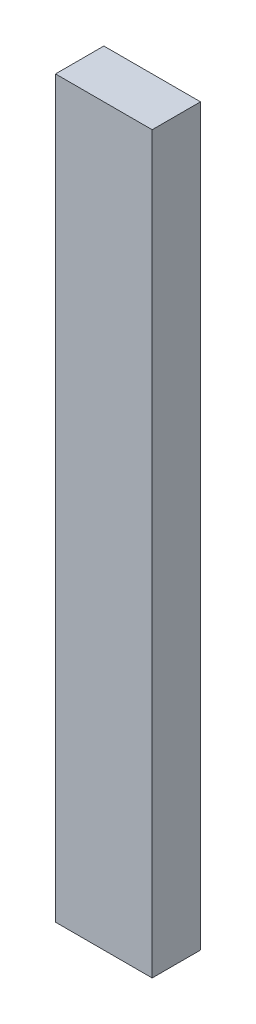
ISO-10303-21;
HEADER;
FILE_DESCRIPTION(('STEP AP214'),'2;1');
FILE_NAME('part.step','',(''),(''),'','','');
FILE_SCHEMA(('AUTOMOTIVE_DESIGN { 1 0 10303 214 1 1 1 1 }'));
ENDSEC;
DATA;
#1=APPLICATION_CONTEXT('core data for automotive mechanical design processes');
#2=APPLICATION_PROTOCOL_DEFINITION('international standard','automotive_design',2000,#1);
#3=PRODUCT_CONTEXT('',#1,'mechanical');
#4=PRODUCT('Part','Part','',(#3));
#5=PRODUCT_RELATED_PRODUCT_CATEGORY('part','',(#4));
#6=PRODUCT_DEFINITION_FORMATION('','',#4);
#7=PRODUCT_DEFINITION_CONTEXT('part definition',#1,'design');
#8=PRODUCT_DEFINITION('design','',#6,#7);
#9=PRODUCT_DEFINITION_SHAPE('','',#8);
#10=(LENGTH_UNIT() NAMED_UNIT(*) SI_UNIT(.MILLI.,.METRE.));
#11=(NAMED_UNIT(*) PLANE_ANGLE_UNIT() SI_UNIT($,.RADIAN.));
#12=(NAMED_UNIT(*) SI_UNIT($,.STERADIAN.) SOLID_ANGLE_UNIT());
#13=UNCERTAINTY_MEASURE_WITH_UNIT(LENGTH_MEASURE(1.E-05),#10,'distance_accuracy_value','');
#14=(GEOMETRIC_REPRESENTATION_CONTEXT(3) GLOBAL_UNCERTAINTY_ASSIGNED_CONTEXT((#13)) GLOBAL_UNIT_ASSIGNED_CONTEXT((#10,
#11,#12)) REPRESENTATION_CONTEXT('',''));
#15=CARTESIAN_POINT('',(0.,0.,0.));
#16=DIRECTION('',(0.,0.,1.));
#17=DIRECTION('',(1.,0.,0.));
#18=AXIS2_PLACEMENT_3D('',#15,#16,#17);
#19=CARTESIAN_POINT('',(0.,0.,2.5));
#20=DIRECTION('',(0.,0.,1.));
#21=DIRECTION('',(1.,0.,0.));
#22=AXIS2_PLACEMENT_3D('',#19,#20,#21);
#23=PLANE('',#22);
#24=DIRECTION('',(-1.,0.,0.));
#25=VECTOR('',#24,1.);
#26=CARTESIAN_POINT('',(0.,-38.,2.5));
#27=LINE('',#26,#25);
#28=CARTESIAN_POINT('',(5.,-38.,2.5));
#29=VERTEX_POINT('',#28);
#30=CARTESIAN_POINT('',(-5.,-38.,2.5));
#31=VERTEX_POINT('',#30);
#32=EDGE_CURVE('E11',#29,#31,#27,.T.);
#33=ORIENTED_EDGE('',*,*,#32,.F.);
#34=DIRECTION('',(0.,-1.,0.));
#35=VECTOR('',#34,1.);
#36=CARTESIAN_POINT('',(5.,0.,2.5));
#37=LINE('',#36,#35);
#38=CARTESIAN_POINT('',(5.,38.,2.5));
#39=VERTEX_POINT('',#38);
#40=EDGE_CURVE('E61',#39,#29,#37,.T.);
#41=ORIENTED_EDGE('',*,*,#40,.F.);
#42=DIRECTION('',(1.,0.,0.));
#43=VECTOR('',#42,1.);
#44=CARTESIAN_POINT('',(0.,38.,2.5));
#45=LINE('',#44,#43);
#46=CARTESIAN_POINT('',(-5.,38.,2.5));
#47=VERTEX_POINT('',#46);
#48=EDGE_CURVE('E87',#47,#39,#45,.T.);
#49=ORIENTED_EDGE('',*,*,#48,.F.);
#50=DIRECTION('',(0.,1.,0.));
#51=VECTOR('',#50,1.);
#52=CARTESIAN_POINT('',(-5.,0.,2.5));
#53=LINE('',#52,#51);
#54=EDGE_CURVE('E24',#31,#47,#53,.T.);
#55=ORIENTED_EDGE('',*,*,#54,.F.);
#56=EDGE_LOOP('',(#33,#41,#49,#55));
#57=FACE_BOUND('',#56,.T.);
#58=ADVANCED_FACE('F17',(#57),#23,.T.);
#59=CARTESIAN_POINT('',(0.,-38.,-2.5));
#60=DIRECTION('',(0.,-1.,0.));
#61=DIRECTION('',(0.,0.,-1.));
#62=AXIS2_PLACEMENT_3D('',#59,#60,#61);
#63=PLANE('',#62);
#64=DIRECTION('',(0.,0.,1.));
#65=VECTOR('',#64,1.);
#66=CARTESIAN_POINT('',(5.,-38.,-2.5));
#67=LINE('',#66,#65);
#68=CARTESIAN_POINT('',(5.,-38.,-2.5));
#69=VERTEX_POINT('',#68);
#70=EDGE_CURVE('E53',#69,#29,#67,.T.);
#71=ORIENTED_EDGE('',*,*,#70,.T.);
#72=ORIENTED_EDGE('',*,*,#32,.T.);
#73=DIRECTION('',(0.,0.,1.));
#74=VECTOR('',#73,1.);
#75=CARTESIAN_POINT('',(-5.,-38.,-2.5));
#76=LINE('',#75,#74);
#77=CARTESIAN_POINT('',(-5.,-38.,-2.5));
#78=VERTEX_POINT('',#77);
#79=EDGE_CURVE('E70',#78,#31,#76,.T.);
#80=ORIENTED_EDGE('',*,*,#79,.F.);
#81=DIRECTION('',(1.,0.,0.));
#82=VECTOR('',#81,1.);
#83=CARTESIAN_POINT('',(0.,-38.,-2.5));
#84=LINE('',#83,#82);
#85=EDGE_CURVE('E65',#78,#69,#84,.T.);
#86=ORIENTED_EDGE('',*,*,#85,.T.);
#87=EDGE_LOOP('',(#71,#72,#80,#86));
#88=FACE_BOUND('',#87,.T.);
#89=ADVANCED_FACE('F66',(#88),#63,.T.);
#90=CARTESIAN_POINT('',(-5.,0.,-2.5));
#91=DIRECTION('',(-1.,0.,0.));
#92=DIRECTION('',(0.,0.,1.));
#93=AXIS2_PLACEMENT_3D('',#90,#91,#92);
#94=PLANE('',#93);
#95=ORIENTED_EDGE('',*,*,#79,.T.);
#96=ORIENTED_EDGE('',*,*,#54,.T.);
#97=DIRECTION('',(0.,0.,1.));
#98=VECTOR('',#97,1.);
#99=CARTESIAN_POINT('',(-5.,38.,-2.5));
#100=LINE('',#99,#98);
#101=CARTESIAN_POINT('',(-5.,38.,-2.5));
#102=VERTEX_POINT('',#101);
#103=EDGE_CURVE('E85',#102,#47,#100,.T.);
#104=ORIENTED_EDGE('',*,*,#103,.F.);
#105=DIRECTION('',(0.,-1.,0.));
#106=VECTOR('',#105,1.);
#107=CARTESIAN_POINT('',(-5.,0.,-2.5));
#108=LINE('',#107,#106);
#109=EDGE_CURVE('E75',#102,#78,#108,.T.);
#110=ORIENTED_EDGE('',*,*,#109,.T.);
#111=EDGE_LOOP('',(#95,#96,#104,#110));
#112=FACE_BOUND('',#111,.T.);
#113=ADVANCED_FACE('F93',(#112),#94,.T.);
#114=CARTESIAN_POINT('',(0.,38.,-2.5));
#115=DIRECTION('',(0.,1.,0.));
#116=DIRECTION('',(0.,0.,1.));
#117=AXIS2_PLACEMENT_3D('',#114,#115,#116);
#118=PLANE('',#117);
#119=ORIENTED_EDGE('',*,*,#103,.T.);
#120=ORIENTED_EDGE('',*,*,#48,.T.);
#121=DIRECTION('',(0.,0.,1.));
#122=VECTOR('',#121,1.);
#123=CARTESIAN_POINT('',(5.,38.,-2.5));
#124=LINE('',#123,#122);
#125=CARTESIAN_POINT('',(5.,38.,-2.5));
#126=VERTEX_POINT('',#125);
#127=EDGE_CURVE('E62',#126,#39,#124,.T.);
#128=ORIENTED_EDGE('',*,*,#127,.F.);
#129=DIRECTION('',(-1.,0.,0.));
#130=VECTOR('',#129,1.);
#131=CARTESIAN_POINT('',(0.,38.,-2.5));
#132=LINE('',#131,#130);
#133=EDGE_CURVE('E76',#126,#102,#132,.T.);
#134=ORIENTED_EDGE('',*,*,#133,.T.);
#135=EDGE_LOOP('',(#119,#120,#128,#134));
#136=FACE_BOUND('',#135,.T.);
#137=ADVANCED_FACE('F90',(#136),#118,.T.);
#138=CARTESIAN_POINT('',(0.,0.,-2.5));
#139=DIRECTION('',(0.,0.,-1.));
#140=DIRECTION('',(-1.,0.,0.));
#141=AXIS2_PLACEMENT_3D('',#138,#139,#140);
#142=PLANE('',#141);
#143=DIRECTION('',(0.,1.,0.));
#144=VECTOR('',#143,1.);
#145=CARTESIAN_POINT('',(5.,0.,-2.5));
#146=LINE('',#145,#144);
#147=EDGE_CURVE('E56',#69,#126,#146,.T.);
#148=ORIENTED_EDGE('',*,*,#147,.F.);
#149=ORIENTED_EDGE('',*,*,#85,.F.);
#150=ORIENTED_EDGE('',*,*,#109,.F.);
#151=ORIENTED_EDGE('',*,*,#133,.F.);
#152=EDGE_LOOP('',(#148,#149,#150,#151));
#153=FACE_BOUND('',#152,.T.);
#154=ADVANCED_FACE('F72',(#153),#142,.T.);
#155=CARTESIAN_POINT('',(5.,0.,-2.5));
#156=DIRECTION('',(1.,0.,0.));
#157=DIRECTION('',(0.,0.,-1.));
#158=AXIS2_PLACEMENT_3D('',#155,#156,#157);
#159=PLANE('',#158);
#160=ORIENTED_EDGE('',*,*,#147,.T.);
#161=ORIENTED_EDGE('',*,*,#127,.T.);
#162=ORIENTED_EDGE('',*,*,#40,.T.);
#163=ORIENTED_EDGE('',*,*,#70,.F.);
#164=EDGE_LOOP('',(#160,#161,#162,#163));
#165=FACE_BOUND('',#164,.T.);
#166=ADVANCED_FACE('F57',(#165),#159,.T.);
#167=CLOSED_SHELL('',(#58,#89,#113,#137,#154,#166));
#168=MANIFOLD_SOLID_BREP('B1',#167);
#169=ADVANCED_BREP_SHAPE_REPRESENTATION('',(#18,#168),#14);
#170=SHAPE_DEFINITION_REPRESENTATION(#9,#169);
ENDSEC;
END-ISO-10303-21;
